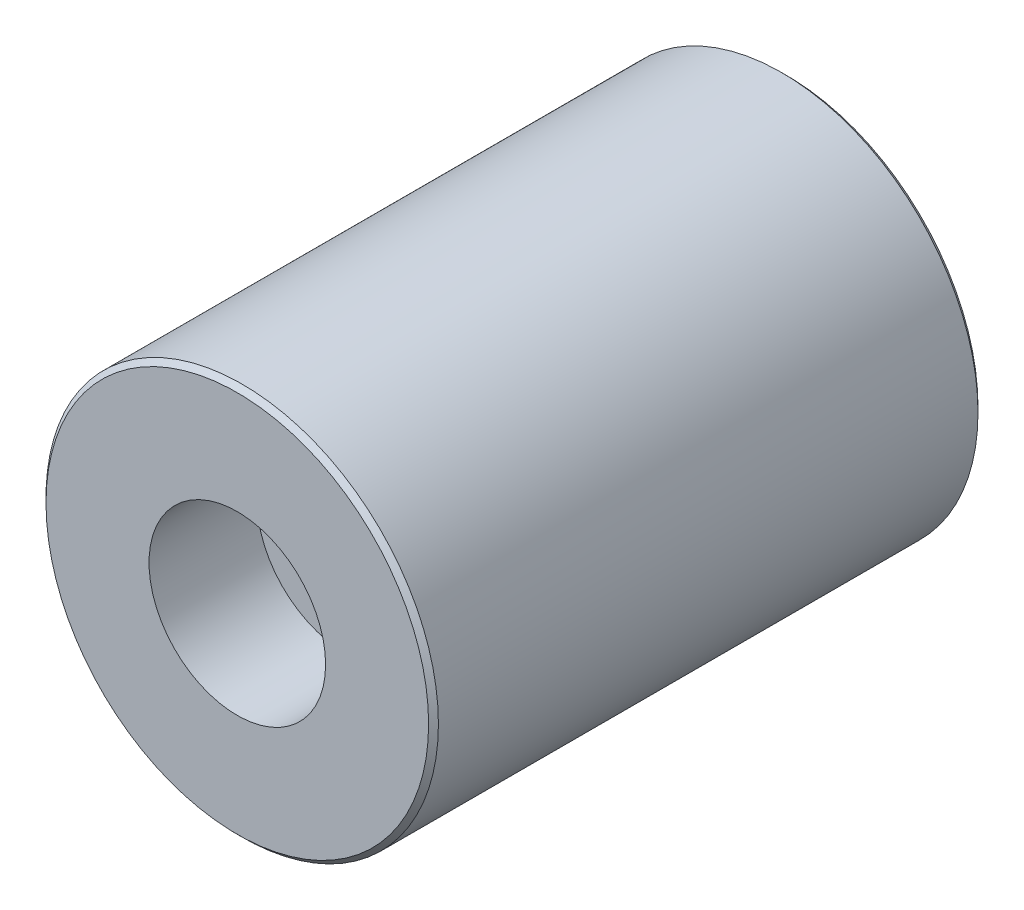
ISO-10303-21;
HEADER;
FILE_DESCRIPTION(('STEP AP214'),'2;1');
FILE_NAME('part.step','',(''),(''),'','','');
FILE_SCHEMA(('AUTOMOTIVE_DESIGN { 1 0 10303 214 1 1 1 1 }'));
ENDSEC;
DATA;
#1=APPLICATION_CONTEXT('core data for automotive mechanical design processes');
#2=APPLICATION_PROTOCOL_DEFINITION('international standard','automotive_design',2000,#1);
#3=PRODUCT_CONTEXT('',#1,'mechanical');
#4=PRODUCT('Part','Part','',(#3));
#5=PRODUCT_RELATED_PRODUCT_CATEGORY('part','',(#4));
#6=PRODUCT_DEFINITION_FORMATION('','',#4);
#7=PRODUCT_DEFINITION_CONTEXT('part definition',#1,'design');
#8=PRODUCT_DEFINITION('design','',#6,#7);
#9=PRODUCT_DEFINITION_SHAPE('','',#8);
#10=(LENGTH_UNIT() NAMED_UNIT(*) SI_UNIT(.MILLI.,.METRE.));
#11=(NAMED_UNIT(*) PLANE_ANGLE_UNIT() SI_UNIT($,.RADIAN.));
#12=(NAMED_UNIT(*) SI_UNIT($,.STERADIAN.) SOLID_ANGLE_UNIT());
#13=UNCERTAINTY_MEASURE_WITH_UNIT(LENGTH_MEASURE(1.E-05),#10,'distance_accuracy_value','');
#14=(GEOMETRIC_REPRESENTATION_CONTEXT(3) GLOBAL_UNCERTAINTY_ASSIGNED_CONTEXT((#13)) GLOBAL_UNIT_ASSIGNED_CONTEXT((#10,
#11,#12)) REPRESENTATION_CONTEXT('',''));
#15=CARTESIAN_POINT('',(0.,0.,0.));
#16=DIRECTION('',(0.,0.,1.));
#17=DIRECTION('',(1.,0.,0.));
#18=AXIS2_PLACEMENT_3D('',#15,#16,#17);
#19=CARTESIAN_POINT('',(0.,0.,0.));
#20=DIRECTION('',(0.,0.,1.));
#21=DIRECTION('',(1.,0.,0.));
#22=AXIS2_PLACEMENT_3D('',#19,#20,#21);
#23=CYLINDRICAL_SURFACE('',#22,9.);
#24=CARTESIAN_POINT('',(0.,0.,-11.));
#25=DIRECTION('',(0.,0.,1.));
#26=DIRECTION('',(1.,0.,0.));
#27=AXIS2_PLACEMENT_3D('',#24,#25,#26);
#28=CIRCLE('',#27,9.);
#29=CARTESIAN_POINT('',(9.,0.,-11.));
#30=VERTEX_POINT('',#29);
#31=EDGE_CURVE('E60',#30,#30,#28,.T.);
#32=ORIENTED_EDGE('',*,*,#31,.F.);
#33=EDGE_LOOP('',(#32));
#34=FACE_BOUND('',#33,.T.);
#35=CARTESIAN_POINT('',(0.,0.,0.));
#36=DIRECTION('',(0.,0.,1.));
#37=DIRECTION('',(1.,0.,0.));
#38=AXIS2_PLACEMENT_3D('',#35,#36,#37);
#39=CIRCLE('',#38,9.);
#40=CARTESIAN_POINT('',(9.,0.,0.));
#41=VERTEX_POINT('',#40);
#42=EDGE_CURVE('E10',#41,#41,#39,.T.);
#43=ORIENTED_EDGE('',*,*,#42,.T.);
#44=EDGE_LOOP('',(#43));
#45=FACE_BOUND('',#44,.T.);
#46=ADVANCED_FACE('F32',(#34,#45),#23,.F.);
#47=CARTESIAN_POINT('',(0.,9.,0.));
#48=DIRECTION('',(0.,0.,-1.));
#49=DIRECTION('',(-1.,0.,0.));
#50=AXIS2_PLACEMENT_3D('',#47,#48,#49);
#51=PLANE('',#50);
#52=ORIENTED_EDGE('',*,*,#42,.F.);
#53=EDGE_LOOP('',(#52));
#54=FACE_BOUND('',#53,.T.);
#55=CARTESIAN_POINT('',(0.,0.,0.));
#56=DIRECTION('',(0.,0.,1.));
#57=DIRECTION('',(1.,0.,0.));
#58=AXIS2_PLACEMENT_3D('',#55,#56,#57);
#59=CIRCLE('',#58,19.5);
#60=CARTESIAN_POINT('',(19.5,0.,0.));
#61=VERTEX_POINT('',#60);
#62=EDGE_CURVE('E38',#61,#61,#59,.T.);
#63=ORIENTED_EDGE('',*,*,#62,.T.);
#64=EDGE_LOOP('',(#63));
#65=FACE_BOUND('',#64,.T.);
#66=ADVANCED_FACE('F67',(#54,#65),#51,.F.);
#67=CARTESIAN_POINT('',(0.,0.,-0.500000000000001));
#68=DIRECTION('',(0.,0.,-1.));
#69=DIRECTION('',(-1.,0.,0.));
#70=AXIS2_PLACEMENT_3D('',#67,#68,#69);
#71=CONICAL_SURFACE('',#70,20.,0.785398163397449);
#72=ORIENTED_EDGE('',*,*,#62,.F.);
#73=EDGE_LOOP('',(#72));
#74=FACE_BOUND('',#73,.T.);
#75=CARTESIAN_POINT('',(0.,0.,-0.500000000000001));
#76=DIRECTION('',(0.,0.,1.));
#77=DIRECTION('',(1.,0.,0.));
#78=AXIS2_PLACEMENT_3D('',#75,#76,#77);
#79=CIRCLE('',#78,20.);
#80=CARTESIAN_POINT('',(20.,0.,-0.500000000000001));
#81=VERTEX_POINT('',#80);
#82=EDGE_CURVE('E42',#81,#81,#79,.T.);
#83=ORIENTED_EDGE('',*,*,#82,.T.);
#84=EDGE_LOOP('',(#83));
#85=FACE_BOUND('',#84,.T.);
#86=ADVANCED_FACE('F71',(#74,#85),#71,.T.);
#87=CARTESIAN_POINT('',(0.,0.,0.));
#88=DIRECTION('',(0.,0.,1.));
#89=DIRECTION('',(1.,0.,0.));
#90=AXIS2_PLACEMENT_3D('',#87,#88,#89);
#91=CYLINDRICAL_SURFACE('',#90,20.);
#92=ORIENTED_EDGE('',*,*,#82,.F.);
#93=EDGE_LOOP('',(#92));
#94=FACE_BOUND('',#93,.T.);
#95=CARTESIAN_POINT('',(0.,0.,-55.5));
#96=DIRECTION('',(0.,0.,1.));
#97=DIRECTION('',(1.,0.,0.));
#98=AXIS2_PLACEMENT_3D('',#95,#96,#97);
#99=CIRCLE('',#98,20.);
#100=CARTESIAN_POINT('',(20.,0.,-55.5));
#101=VERTEX_POINT('',#100);
#102=EDGE_CURVE('E46',#101,#101,#99,.T.);
#103=ORIENTED_EDGE('',*,*,#102,.T.);
#104=EDGE_LOOP('',(#103));
#105=FACE_BOUND('',#104,.T.);
#106=ADVANCED_FACE('F76',(#94,#105),#91,.T.);
#107=CARTESIAN_POINT('',(0.,0.,-56.));
#108=DIRECTION('',(0.,0.,1.));
#109=DIRECTION('',(1.,0.,0.));
#110=AXIS2_PLACEMENT_3D('',#107,#108,#109);
#111=CONICAL_SURFACE('',#110,19.5,0.785398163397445);
#112=ORIENTED_EDGE('',*,*,#102,.F.);
#113=EDGE_LOOP('',(#112));
#114=FACE_BOUND('',#113,.T.);
#115=CARTESIAN_POINT('',(0.,0.,-56.));
#116=DIRECTION('',(0.,0.,1.));
#117=DIRECTION('',(1.,0.,0.));
#118=AXIS2_PLACEMENT_3D('',#115,#116,#117);
#119=CIRCLE('',#118,19.5);
#120=CARTESIAN_POINT('',(19.5,0.,-56.));
#121=VERTEX_POINT('',#120);
#122=EDGE_CURVE('E51',#121,#121,#119,.T.);
#123=ORIENTED_EDGE('',*,*,#122,.T.);
#124=EDGE_LOOP('',(#123));
#125=FACE_BOUND('',#124,.T.);
#126=ADVANCED_FACE('F82',(#114,#125),#111,.T.);
#127=CARTESIAN_POINT('',(0.,19.5,-56.));
#128=DIRECTION('',(0.,0.,1.));
#129=DIRECTION('',(1.,0.,0.));
#130=AXIS2_PLACEMENT_3D('',#127,#128,#129);
#131=PLANE('',#130);
#132=ORIENTED_EDGE('',*,*,#122,.F.);
#133=EDGE_LOOP('',(#132));
#134=FACE_BOUND('',#133,.T.);
#135=CARTESIAN_POINT('',(0.,0.,-56.));
#136=DIRECTION('',(0.,0.,1.));
#137=DIRECTION('',(1.,0.,0.));
#138=AXIS2_PLACEMENT_3D('',#135,#136,#137);
#139=CIRCLE('',#138,5.5);
#140=CARTESIAN_POINT('',(5.5,0.,-56.));
#141=VERTEX_POINT('',#140);
#142=EDGE_CURVE('E54',#141,#141,#139,.T.);
#143=ORIENTED_EDGE('',*,*,#142,.T.);
#144=EDGE_LOOP('',(#143));
#145=FACE_BOUND('',#144,.T.);
#146=ADVANCED_FACE('F86',(#134,#145),#131,.F.);
#147=CARTESIAN_POINT('',(0.,0.,0.));
#148=DIRECTION('',(0.,0.,1.));
#149=DIRECTION('',(1.,0.,0.));
#150=AXIS2_PLACEMENT_3D('',#147,#148,#149);
#151=CYLINDRICAL_SURFACE('',#150,5.5);
#152=ORIENTED_EDGE('',*,*,#142,.F.);
#153=EDGE_LOOP('',(#152));
#154=FACE_BOUND('',#153,.T.);
#155=CARTESIAN_POINT('',(0.,0.,-11.));
#156=DIRECTION('',(0.,0.,1.));
#157=DIRECTION('',(1.,0.,0.));
#158=AXIS2_PLACEMENT_3D('',#155,#156,#157);
#159=CIRCLE('',#158,5.5);
#160=CARTESIAN_POINT('',(5.5,0.,-11.));
#161=VERTEX_POINT('',#160);
#162=EDGE_CURVE('E57',#161,#161,#159,.T.);
#163=ORIENTED_EDGE('',*,*,#162,.T.);
#164=EDGE_LOOP('',(#163));
#165=FACE_BOUND('',#164,.T.);
#166=ADVANCED_FACE('F90',(#154,#165),#151,.F.);
#167=CARTESIAN_POINT('',(0.,5.5,-11.));
#168=DIRECTION('',(0.,0.,-1.));
#169=DIRECTION('',(-1.,0.,0.));
#170=AXIS2_PLACEMENT_3D('',#167,#168,#169);
#171=PLANE('',#170);
#172=ORIENTED_EDGE('',*,*,#162,.F.);
#173=EDGE_LOOP('',(#172));
#174=FACE_BOUND('',#173,.T.);
#175=ORIENTED_EDGE('',*,*,#31,.T.);
#176=EDGE_LOOP('',(#175));
#177=FACE_BOUND('',#176,.T.);
#178=ADVANCED_FACE('F64',(#174,#177),#171,.F.);
#179=CLOSED_SHELL('',(#46,#66,#86,#106,#126,#146,#166,#178));
#180=MANIFOLD_SOLID_BREP('B2',#179);
#181=ADVANCED_BREP_SHAPE_REPRESENTATION('',(#18,#180),#14);
#182=SHAPE_DEFINITION_REPRESENTATION(#9,#181);
ENDSEC;
END-ISO-10303-21;
